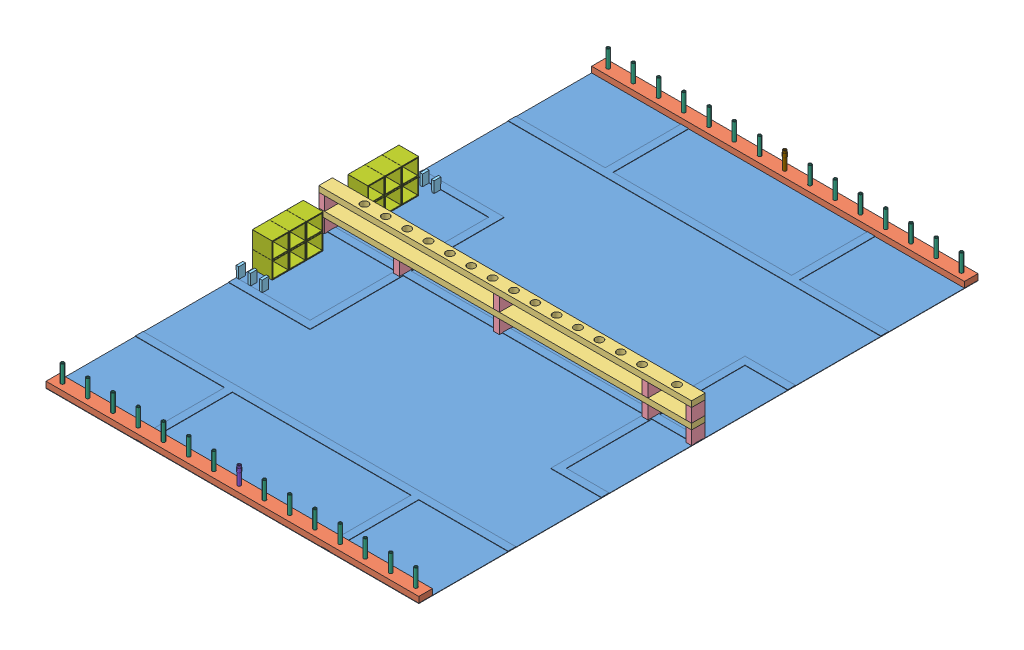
SolidWorks assembly 2020 Field Assembly.SLDASM, configuration Default (file format 12000). Lengths in mm.
Overall size (2438.4 256.54 3657.6).
64 component instances, 9 part files, 87 mates.
Components (placement in the parent):
- Floor-1: Floor.SLDPRT [Default] at (0 0 1828.8) size (2438.4 5.08 3657.6)
- Starting Piece-4: Starting Piece.SLDPRT [Default] at (0 2.54 1828.8) size (2438.4 38.1 88.9)
- Test Tube Rack-1: Test Tube Rack.SLDPRT [Bottom Shelf] at (0 91.44 44.45) size (2438.4 38.1 88.9)
- Spacer-1: Spacer.SLDPRT [Default] at (2438.4 2.54 44.45) x (0 1 0) z (0 0 1) size (88.9 38.1 88.9)
- Spacer-2: Spacer.SLDPRT [Default] at (38.1 2.54 44.45) x (0 1 0) z (0 0 1) size (88.9 38.1 88.9)
- Sample (tic tac box)-1: Sample (tic tac box).SLDPRT [Default] at (169.0687 2.54 541.3375) x (0 0 1) z (-1 0 0) size (44.45 73.03 16.67)
- Sample (tic tac box)-3: Sample (tic tac box).SLDPRT [Default] at (16.6687 2.54 541.3375) x (0 0 1) z (-1 0 0) size (44.45 73.03 16.67)
- Sample (tic tac box)-4: Sample (tic tac box).SLDPRT [Default] at (92.8688 2.54 541.3375) x (0 0 1) z (-1 0 0) size (44.45 73.03 16.67)
- Spacer-3: Spacer.SLDPRT [Default] at (527.05 2.54 44.45) x (0 1 0) z (0 0 1) size (88.9 38.1 88.9)
- Test Tube-1: Test Tube.SLDPRT [Default] at (2374.9 2.54 1784.35) x (0.214665 0 0.976688) z (-0.976688 0 0.214665) size (21.34 152.4 21.34)
- Test Tube-2: Test Tube.SLDPRT [Default] at (1714.5 2.54 1784.35) x (-0.112737 0 0.993625) z (-0.993625 0 -0.112737) size (21.34 152.4 21.34)
- Test Tube-3: Test Tube.SLDPRT [Default] at (889 2.54 1784.35) x (0.923132 0 0.384484) z (-0.384484 0 0.923132) size (21.34 152.4 21.34)
- Test Tube-4: Test Tube.SLDPRT [Default] at (1054.1 2.54 1784.35) x (0.923132 0 0.384484) z (-0.384484 0 0.923132) size (21.34 152.4 21.34)
- Test Tube-5: Test Tube.SLDPRT [Default] at (2044.7 2.54 1784.35) x (0.923132 0 0.384484) z (-0.384484 0 0.923132) size (21.34 152.4 21.34)
- Test Tube-6: Test Tube.SLDPRT [Default] at (1384.3 2.54 1784.35) x (0.923132 0 0.384484) z (-0.384484 0 0.923132) size (21.34 152.4 21.34)
- Test Tube-7: Test Tube.SLDPRT [Default] at (1879.6 2.54 1784.35) x (0.923132 0 0.384484) z (-0.384484 0 0.923132) size (21.34 152.4 21.34)
- Test Tube-9: Test Tube.SLDPRT [Default] at (1549.4 2.54 1784.35) x (0.923132 0 0.384484) z (-0.384484 0 0.923132) size (21.34 152.4 21.34)
- Test Tube-10: Test Tube.SLDPRT [Default] at (2209.8 2.54 1784.35) x (0.923132 0 0.384484) z (-0.384484 0 0.923132) size (21.34 152.4 21.34)
- Test Tube-11: Test Tube.SLDPRT [Default] at (63.5 2.54 1784.35) x (0.3427 0 -0.939445) z (0.939445 0 0.3427) size (21.34 152.4 21.34)
- Test Tube-12: Test Tube.SLDPRT [Default] at (228.6 2.54 1784.35) x (0.923132 0 0.384484) z (-0.384484 0 0.923132) size (21.34 152.4 21.34)
- Test Tube-13: Test Tube.SLDPRT [Default] at (393.7 2.54 1784.35) x (-0.643462 0 -0.765478) z (0.765478 0 -0.643462) size (21.34 152.4 21.34)
- Test Tube-14: Test Tube.SLDPRT [Default] at (558.8 2.54 1784.35) x (-0.689225 0 0.724547) z (-0.724547 0 -0.689225) size (21.34 152.4 21.34)
- Test Tube-15: Test Tube.SLDPRT [Default] at (723.9 2.54 1784.35) x (0.923132 0 0.384484) z (-0.384484 0 0.923132) size (21.34 152.4 21.34)
- Spacer-4: Spacer.SLDPRT [Default] at (2152.65 2.54 44.45) x (0 1 0) z (0 0 1) size (88.9 38.1 88.9)
- Sample (tic tac box)-5: Sample (tic tac box).SLDPRT [Default] at (152.4 2.54 -541.3375) x (0 0 -1) z (1 0 0) size (44.45 73.03 16.67)
- Sample (tic tac box)-6: Sample (tic tac box).SLDPRT [Default] at (76.2 2.54 -541.3375) x (0 0 -1) z (1 0 0) size (44.45 73.03 16.67)
- Sample (tic tac box)-7: Sample (tic tac box).SLDPRT [Default] at (0 2.54 -541.3375) x (0 0 -1) z (1 0 0) size (44.45 73.03 16.67)
- Starting Piece-8: Starting Piece.SLDPRT [Default] at (0 2.54 -1739.9) size (2438.4 38.1 88.9)
- Test Tube-16: Test Tube.SLDPRT [Default] at (723.9 2.54 -1784.35) x (0.923132 0 -0.384484) z (0.384484 0 0.923132) size (21.34 152.4 21.34)
- Test Tube-17: Test Tube.SLDPRT [Default] at (558.8 2.54 -1784.35) x (-0.689225 0 -0.724547) z (0.724547 0 -0.689225) size (21.34 152.4 21.34)
- Test Tube-18: Test Tube.SLDPRT [Default] at (393.7 2.54 -1784.35) x (-0.643462 0 0.765478) z (-0.765478 0 -0.643462) size (21.34 152.4 21.34)
- Test Tube-19: Test Tube.SLDPRT [Default] at (228.6 2.54 -1784.35) x (0.923132 0 -0.384484) z (0.384484 0 0.923132) size (21.34 152.4 21.34)
- Test Tube-20: Test Tube.SLDPRT [Default] at (63.5 2.54 -1784.35) x (0.3427 0 0.939445) z (-0.939445 0 0.3427) size (21.34 152.4 21.34)
- Test Tube-21: Test Tube.SLDPRT [Default] at (2209.8 2.54 -1784.35) x (0.923132 0 -0.384484) z (0.384484 0 0.923132) size (21.34 152.4 21.34)
- Test Tube-22: Test Tube.SLDPRT [Default] at (1549.4 2.54 -1784.35) x (0.923132 0 -0.384484) z (0.384484 0 0.923132) size (21.34 152.4 21.34)
- Test Tube-24: Test Tube.SLDPRT [Default] at (1879.6 2.54 -1784.35) x (0.923132 0 -0.384484) z (0.384484 0 0.923132) size (21.34 152.4 21.34)
- Test Tube-25: Test Tube.SLDPRT [Default] at (1384.3 2.54 -1784.35) x (0.923132 0 -0.384484) z (0.384484 0 0.923132) size (21.34 152.4 21.34)
- Test Tube-26: Test Tube.SLDPRT [Default] at (2044.7 2.54 -1784.35) x (0.923132 0 -0.384484) z (0.384484 0 0.923132) size (21.34 152.4 21.34)
- Test Tube-27: Test Tube.SLDPRT [Default] at (1054.1 2.54 -1784.35) x (0.923132 0 -0.384484) z (0.384484 0 0.923132) size (21.34 152.4 21.34)
- Test Tube-28: Test Tube.SLDPRT [Default] at (889 2.54 -1784.35) x (0.923132 0 -0.384484) z (0.384484 0 0.923132) size (21.34 152.4 21.34)
- Test Tube-29: Test Tube.SLDPRT [Default] at (1714.5 2.54 -1784.35) x (-0.112737 0 -0.993625) z (0.993625 0 -0.112737) size (21.34 152.4 21.34)
- Test Tube-30: Test Tube.SLDPRT [Default] at (2374.9 2.54 -1784.35) x (0.214665 0 -0.976688) z (0.976688 0 0.214665) size (21.34 152.4 21.34)
- Centrifuge-1: Centrifuge.SLDASM [Default] at (0 2.54 479.425) size (130.18 222.25 333.38)
  - Tissue Box-1: Tissue Box.SLDPRT [Default] at (0 111.125 0) x (0 -1 0) z (0 0 1) size (111.12 130.18 111.12)
  - Tissue Box-2: Tissue Box.SLDPRT [Default] at (0 222.25 0) x (0 -1 0) z (0 0 1) size (111.12 130.18 111.12)
  - Tissue Box-3: Tissue Box.SLDPRT [Default] at (0 111.125 -111.125) x (0 -1 0) z (0 0 1) size (111.12 130.18 111.12)
  - Tissue Box-4: Tissue Box.SLDPRT [Default] at (0 111.125 -222.25) x (0 -1 0) z (0 0 1) size (111.12 130.18 111.12)
  - Tissue Box-5: Tissue Box.SLDPRT [Default] at (0 222.25 -222.25) x (0 -1 0) z (0 0 1) size (111.12 130.18 111.12)
  - Tissue Box-6: Tissue Box.SLDPRT [Default] at (0 222.25 -111.125) x (0 -1 0) z (0 0 1) size (111.12 130.18 111.12)
- Centrifuge-2: Centrifuge.SLDASM [Default] at (0 224.79 -479.425) x (1 0 0) z (0 0 -1) size (130.18 222.25 333.38)
  - Tissue Box-1: Tissue Box.SLDPRT [Default] at (0 111.125 0) x (0 -1 0) z (0 0 1) size (111.12 130.18 111.12)
  - Tissue Box-2: Tissue Box.SLDPRT [Default] at (0 222.25 0) x (0 -1 0) z (0 0 1) size (111.12 130.18 111.12)
  - Tissue Box-3: Tissue Box.SLDPRT [Default] at (0 111.125 -111.125) x (0 -1 0) z (0 0 1) size (111.12 130.18 111.12)
  - Tissue Box-4: Tissue Box.SLDPRT [Default] at (0 111.125 -222.25) x (0 -1 0) z (0 0 1) size (111.12 130.18 111.12)
  - Tissue Box-5: Tissue Box.SLDPRT [Default] at (0 222.25 -222.25) x (0 -1 0) z (0 0 1) size (111.12 130.18 111.12)
  - Tissue Box-6: Tissue Box.SLDPRT [Default] at (0 222.25 -111.125) x (0 -1 0) z (0 0 1) size (111.12 130.18 111.12)
- Spacer-5: Spacer.SLDPRT [Default] at (2438.4 129.54 44.45) x (0 1 0) z (0 0 1) size (88.9 38.1 88.9)
- Spacer-6: Spacer.SLDPRT [Default] at (2152.65 129.54 44.45) x (0 1 0) z (0 0 1) size (88.9 38.1 88.9)
- Spacer-7: Spacer.SLDPRT [Default] at (38.1 129.54 44.45) x (0 1 0) z (0 0 1) size (88.9 38.1 88.9)
- Spacer-8: Spacer.SLDPRT [Default] at (1181.1 129.54 44.45) x (0 1 0) z (0 0 1) size (88.9 38.1 88.9)
- Test Tube Rack-2: Test Tube Rack.SLDPRT [Default] at (0 218.44 44.45) size (2438.4 38.1 88.9)
- Spacer-9: Spacer.SLDPRT [Default] at (1181.1 2.54 44.45) x (0 1 0) z (0 0 1) size (88.9 38.1 88.9)
- Collabortention Test Tube Red-1: Collabortention Test Tube Red.SLDPRT [Default] at (1219.2 2.54 1784.35) size (23.88 152.4 23.88)
- Collabortention Test Tube Blue-1: Collabortention Test Tube Blue.SLDPRT [Default] at (1219.2 2.54 -1784.35) size (23.88 152.4 23.88)
Mates (geometry in assembly coordinates):
- Coincident9: coincident anti-aligned: plane of Floor-1 through (0 2.54 1828.8) normal (0 1 0); plane of Spacer-2 through (0 2.54 44.45) normal (0 -1 0)
- Coincident10: coincident anti-aligned: plane of Floor-1 through (0 2.54 1828.8) normal (0 1 0); plane of Spacer-1 through (2400.3 2.54 44.45) normal (0 -1 0)
- Coincident11: coincident aligned: plane of Test Tube Rack-1 through (0 129.54 44.45) normal (0 0 1); plane of Spacer-2 through (0 2.54 44.45) normal (0 0 1)
- Coincident12: coincident anti-aligned: plane of Test Tube Rack-1 through (0 91.44 44.45) normal (0 -1 0); plane of Spacer-2 through (0 91.44 44.45) normal (0 1 0)
- Coincident13: coincident aligned: plane of Test Tube Rack-1 through (0 129.54 44.45) normal (-1 0 0); plane of Spacer-2 through (0 2.54 44.45) normal (-1 0 0)
- Coincident14: coincident aligned: plane of Floor-1 through (0 2.54 1828.8) normal (-1 0 0); plane of Spacer-2 through (0 2.54 44.45) normal (-1 0 0)
- Coincident15: coincident anti-aligned: plane of Test Tube Rack-1 through (0 91.44 44.45) normal (0 -1 0); plane of Spacer-1 through (2400.3 91.44 44.45) normal (0 1 0)
- Coincident16: coincident aligned: plane of Test Tube Rack-1 through (0 129.54 44.45) normal (0 0 1); plane of Spacer-1 through (2400.3 2.54 44.45) normal (0 0 1)
- Coincident17: coincident aligned: plane of Floor-1 through (2438.4 2.54 1828.8) normal (1 0 0); plane of Spacer-1 through (2438.4 2.54 44.45) normal (1 0 0)
- Width1: width aligned: plane of Spacer-1 through (2400.3 2.54 44.45) normal (0 0 1); plane of Spacer-1 through (2400.3 2.54 -44.45) normal (0 0 -1); plane of Floor-1 through (0 2.54 1828.8) normal (0 0 1); plane of Floor-1 through (0 2.54 -1828.8) normal (0 0 -1)
- Coincident50: coincident anti-aligned: plane of Floor-1 through (0 2.54 1828.8) normal (0 1 0); plane of Starting Piece-4 through (0 2.54 1828.8) normal (0 -1 0)
- Coincident51: coincident aligned: plane of Floor-1 through (0 2.54 1828.8) normal (0 0 1); plane of Starting Piece-4 through (0 40.64 1828.8) normal (0 0 1)
- Coincident58: coincident anti-aligned: plane of Floor-1 through (0 2.54 1828.8) normal (0 1 0); plane of Sample (tic tac box)-1 through (152.4 2.54 541.3375) normal (0 -1 0)
- Coincident59: coincident anti-aligned: plane of Floor-1 through (0 2.54 1828.8) normal (0 1 0); plane of Sample (tic tac box)-4 through (76.2 2.54 541.3375) normal (0 -1 0)
- Coincident60: coincident anti-aligned: plane of Floor-1 through (0 2.54 1828.8) normal (0 1 0); plane of Sample (tic tac box)-3 through (0 2.54 541.3375) normal (0 -1 0)
- Coincident61: coincident: plane of Floor-1 through (0 2.54 1828.8) normal (-1 0 0); line of Sample (tic tac box)-3 through (0 75.565 584.9937) axis (0 0 -1)
- Coincident63: coincident aligned: plane of Sample (tic tac box)-1 through (152.4 2.54 584.2) normal (0 -0.010869 0.999941); plane of Sample (tic tac box)-4 through (76.2 2.54 584.2) normal (0 -0.010869 0.999941)
- Coincident64: coincident aligned: plane of Sample (tic tac box)-3 through (0 2.54 584.2) normal (0 -0.010869 0.999941); plane of Sample (tic tac box)-4 through (76.2 2.54 584.2) normal (0 -0.010869 0.999941)
- Width3: width anti-aligned: plane of Sample (tic tac box)-3 through (15.8751 2.5486 540.5438) normal (0.999941 -0.010869 0); plane of Sample (tic tac box)-4 through (153.1956 2.3675 540.5438) normal (-0.999941 -0.010869 0); plane of Sample (tic tac box)-1 through (76.9956 2.3675 540.5438) normal (-0.999941 -0.010869 0); plane of Sample (tic tac box)-4 through (92.0751 2.5486 540.5438) normal (0.999941 -0.010869 0)
- Coincident65: coincident aligned: line of Floor-1 through (15.875 2.54 584.2) axis (1 0 0); line of Sample (tic tac box)-4 through (76.9938 2.54 584.2) axis (1 0 0)
- Coincident66: coincident aligned: plane of Test Tube Rack-1 through (0 129.54 44.45) normal (0 0 1); plane of Spacer-3 through (488.95 2.54 44.45) normal (0 0 1)
- Coincident67: coincident anti-aligned: plane of Floor-1 through (0 2.54 1828.8) normal (0 1 0); plane of Spacer-3 through (488.95 2.54 44.45) normal (0 -1 0)
- Distance2: distance = 450.85 mm anti-aligned: plane of Spacer-3 through (488.95 2.54 44.45) normal (-1 0 0); plane of Spacer-2 through (38.1 2.54 44.45) normal (1 0 0)
- Coincident85: coincident anti-aligned: plane of Test Tube Rack-1 through (0 91.44 44.45) normal (0 -1 0); plane of Spacer-4 through (2114.55 91.44 44.45) normal (0 1 0)
- Coincident86: coincident aligned: plane of Test Tube Rack-1 through (0 129.54 44.45) normal (0 0 1); plane of Spacer-4 through (2114.55 2.54 44.45) normal (0 0 1)
- Distance3: distance = 247.65 mm anti-aligned: plane of Spacer-4 through (2152.65 2.54 44.45) normal (1 0 0); plane of Spacer-1 through (2400.3 2.54 44.45) normal (-1 0 0)
- Symmetric2: symmetric aligned: plane of Floor-1 through (0 2.54 1828.8) normal (0 0 1); plane of Floor-1 through (0 2.54 -1828.8) normal (0 0 -1)
- Coincident88: coincident anti-aligned: plane of Floor-1 through (0 0 1828.8) normal (0 -1 0)
- Coincident89: coincident anti-aligned: plane of Floor-1 through (0 2.54 1828.8) normal (-1 0 0)
- Coincident91: coincident anti-aligned: plane of Floor-1 through (0 2.54 1828.8) normal (0 1 0); plane of Centrifuge-1/Tissue Box-1 through (130.175 2.54 479.425) normal (0 -1 0)
- Distance4: distance = 101.6 mm anti-aligned: plane of Centrifuge-1/Tissue Box-5 through (130.175 224.79 146.05) normal (0 0 -1); plane of Test Tube Rack-1 through (0 129.54 44.45) normal (0 0 1)
- Coincident93: coincident aligned: plane of Floor-1 through (0 2.54 1828.8) normal (-1 0 0); plane of Centrifuge-1/Tissue Box-5 through (0 224.79 257.175) normal (-1 0 0)
- Coincident94: coincident anti-aligned: plane of Floor-1 through (0 2.54 1828.8) normal (0 1 0); plane of Centrifuge-2/Tissue Box-5 through (130.175 2.54 -257.175) normal (0 -1 0)
- Coincident95: coincident aligned: plane of Floor-1 through (0 2.54 1828.8) normal (-1 0 0); plane of Centrifuge-2/Tissue Box-6 through (0 2.54 -368.3) normal (-1 0 0)
- Distance5: distance = 101.6 mm anti-aligned: plane of Centrifuge-2/Tissue Box-5 through (130.175 2.54 -146.05) normal (0 0 1); plane of Spacer-2 through (0 2.54 -44.45) normal (0 0 -1)
- Coincident97: coincident aligned: plane of Floor-1 through (2438.4 2.54 1828.8) normal (1 0 0); plane of Starting Piece-4 through (2438.4 40.64 1828.8) normal (1 0 0)
- Coincident98: coincident aligned: plane of Test Tube Rack-1 through (0 129.54 44.45) normal (0 0 1); plane of Spacer-8 through (1143 129.54 44.45) normal (0 0 1)
- Coincident99: coincident aligned: plane of Test Tube Rack-1 through (0 129.54 44.45) normal (0 0 1); plane of Spacer-6 through (2114.55 129.54 44.45) normal (0 0 1)
- Coincident100: coincident aligned: plane of Test Tube Rack-1 through (0 129.54 44.45) normal (0 0 1); plane of Spacer-5 through (2400.3 129.54 44.45) normal (0 0 1)
- Coincident101: coincident aligned: plane of Test Tube Rack-1 through (0 129.54 44.45) normal (0 0 1); plane of Spacer-7 through (0 129.54 44.45) normal (0 0 1)
- Coincident102: coincident aligned: plane of Test Tube Rack-1 through (0 129.54 44.45) normal (0 0 1); plane of Test Tube Rack-2 through (0 256.54 44.45) normal (0 0 1)
- Coincident103: coincident anti-aligned: plane of Test Tube Rack-1 through (0 129.54 44.45) normal (0 1 0); plane of Spacer-7 through (0 129.54 44.45) normal (0 -1 0)
- Coincident104: coincident anti-aligned: plane of Test Tube Rack-1 through (0 129.54 44.45) normal (0 1 0); plane of Spacer-8 through (1143 129.54 44.45) normal (0 -1 0)
- Coincident105: coincident anti-aligned: plane of Test Tube Rack-1 through (0 129.54 44.45) normal (0 1 0); plane of Spacer-6 through (2114.55 129.54 44.45) normal (0 -1 0)
- Coincident106: coincident anti-aligned: plane of Test Tube Rack-1 through (0 129.54 44.45) normal (0 1 0); plane of Spacer-5 through (2400.3 129.54 44.45) normal (0 -1 0)
- Coincident107: coincident aligned: plane of Spacer-1 through (2438.4 2.54 44.45) normal (1 0 0); plane of Spacer-5 through (2438.4 129.54 44.45) normal (1 0 0)
- Coincident108: coincident aligned: plane of Spacer-4 through (2152.65 2.54 44.45) normal (1 0 0); plane of Spacer-6 through (2152.65 129.54 44.45) normal (1 0 0)
- Coincident109: coincident aligned: plane of Spacer-5 through (2438.4 129.54 44.45) normal (1 0 0); plane of Test Tube Rack-2 through (2438.4 256.54 44.45) normal (1 0 0)
- Coincident110: coincident anti-aligned: plane of Spacer-6 through (2114.55 218.44 44.45) normal (0 1 0); plane of Test Tube Rack-2 through (0 218.44 44.45) normal (0 -1 0)
- Coincident111: coincident aligned: plane of Spacer-7 through (0 129.54 44.45) normal (-1 0 0); plane of Test Tube Rack-2 through (0 256.54 44.45) normal (-1 0 0)
- Distance6: distance = 933.45 mm anti-aligned: plane of Spacer-8 through (1181.1 129.54 44.45) normal (1 0 0); plane of Spacer-6 through (2114.55 129.54 44.45) normal (-1 0 0)
- Coincident113: coincident anti-aligned: plane of Floor-1 through (0 2.54 1828.8) normal (0 1 0); plane of Spacer-9 through (1143 2.54 44.45) normal (0 -1 0)
- Coincident114: coincident aligned: plane of Spacer-8 through (1143 129.54 44.45) normal (0 0 1); plane of Spacer-9 through (1143 2.54 44.45) normal (0 0 1)
- Coincident115: coincident aligned: plane of Spacer-8 through (1181.1 129.54 44.45) normal (1 0 0); plane of Spacer-9 through (1181.1 2.54 44.45) normal (1 0 0)
- Coincident116: coincident anti-aligned: plane of Floor-1 through (0 2.54 1828.8) normal (0 1 0); plane of Test Tube-7 through (1879.6 2.54 1784.35) normal (0 -1 0)
- Coincident117: coincident anti-aligned: plane of Floor-1 through (0 2.54 1828.8) normal (0 1 0); plane of Test Tube-9 through (1549.4 2.54 1784.35) normal (0 -1 0)
- Coincident118: coincident anti-aligned: plane of Floor-1 through (0 2.54 1828.8) normal (0 1 0); plane of Test Tube-1 through (2374.9 2.54 1784.35) normal (0 -1 0)
- Coincident119: coincident anti-aligned: plane of Floor-1 through (0 2.54 1828.8) normal (0 1 0); plane of Test Tube-10 through (2209.8 2.54 1784.35) normal (0 -1 0)
- Coincident120: coincident aligned: plane of Floor-1 through (0 2.54 1828.8) normal (0 1 0); circle of Test Tube-4
- Coincident121: coincident aligned: plane of Floor-1 through (0 2.54 1828.8) normal (0 1 0); circle of Test Tube-5
- Coincident122: coincident anti-aligned: plane of Floor-1 through (0 2.54 1828.8) normal (0 1 0); plane of Test Tube-3 through (889 2.54 1784.35) normal (0 -1 0)
- Coincident123: coincident anti-aligned: plane of Floor-1 through (0 2.54 1828.8) normal (0 1 0); plane of Test Tube-2 through (1714.5 2.54 1784.35) normal (0 -1 0)
- Coincident125: coincident anti-aligned: plane of Floor-1 through (0 2.54 1828.8) normal (0 1 0); plane of Test Tube-15 through (723.9 2.54 1784.35) normal (0 -1 0)
- Coincident126: coincident anti-aligned: plane of Floor-1 through (0 2.54 1828.8) normal (0 1 0); plane of Test Tube-14 through (558.8 2.54 1784.35) normal (0 -1 0)
- Coincident127: coincident anti-aligned: plane of Floor-1 through (0 2.54 1828.8) normal (0 1 0); plane of Test Tube-13 through (393.7 2.54 1784.35) normal (0 -1 0)
- Coincident128: coincident anti-aligned: plane of Floor-1 through (0 2.54 1828.8) normal (0 1 0); plane of Test Tube-12 through (228.6 2.54 1784.35) normal (0 -1 0)
- Coincident129: coincident anti-aligned: plane of Floor-1 through (0 2.54 1828.8) normal (0 1 0); plane of Test Tube-11 through (63.5 2.54 1784.35) normal (0 -1 0)
- Concentric3: concentric anti-aligned: cylinder of Starting Piece-4 through (1054.1 2.54 1784.35) axis (0 1 0) radius 11.1125; cylinder of Test Tube-4 through (1054.1 154.94 1784.35) axis (0 -1 0) radius 10.668
- Concentric4: concentric anti-aligned: cylinder of Starting Piece-4 through (889 2.54 1784.35) axis (0 1 0) radius 11.1125; cylinder of Test Tube-3 through (889 154.94 1784.35) axis (0 -1 0) radius 10.668
- Concentric5: concentric anti-aligned: circle of Starting Piece-4; cylinder of Test Tube-15 through (723.9 154.94 1784.35) axis (0 -1 0) radius 10.668
- Concentric6: concentric anti-aligned: circle of Starting Piece-4; cylinder of Test Tube-14 through (558.8 154.94 1784.35) axis (0 -1 0) radius 10.668
- Concentric7: concentric anti-aligned: circle of Starting Piece-4; cylinder of Test Tube-13 through (393.7 154.94 1784.35) axis (0 -1 0) radius 10.668
- Concentric8: concentric anti-aligned: circle of Starting Piece-4; cylinder of Test Tube-12 through (228.6 154.94 1784.35) axis (0 -1 0) radius 10.668
- Concentric9: concentric anti-aligned: cylinder of Starting Piece-4 through (63.5 2.54 1784.35) axis (0 1 0) radius 11.1125; cylinder of Test Tube-11 through (63.5 154.94 1784.35) axis (0 -1 0) radius 10.668
- Concentric10: concentric anti-aligned: circle of Starting Piece-4; cylinder of Test Tube-6 through (1384.3 154.94 1784.35) axis (0 -1 0) radius 10.668
- Concentric11: concentric anti-aligned: cylinder of Starting Piece-4 through (1549.4 2.54 1784.35) axis (0 1 0) radius 11.1125; cylinder of Test Tube-9 through (1549.4 154.94 1784.35) axis (0 -1 0) radius 10.668
- Concentric12: concentric anti-aligned: circle of Starting Piece-4; cylinder of Test Tube-2 through (1714.5 154.94 1784.35) axis (0 -1 0) radius 10.668
- Concentric13: concentric anti-aligned: circle of Starting Piece-4; cylinder of Test Tube-7 through (1879.6 154.94 1784.35) axis (0 -1 0) radius 10.668
- Concentric14: concentric anti-aligned: circle of Starting Piece-4; cylinder of Test Tube-5 through (2044.7 154.94 1784.35) axis (0 -1 0) radius 10.668
- Concentric15: concentric anti-aligned: circle of Starting Piece-4; cylinder of Test Tube-10 through (2209.8 154.94 1784.35) axis (0 -1 0) radius 10.668
- Concentric16: concentric anti-aligned: circle of Starting Piece-4; cylinder of Test Tube-1 through (2374.9 154.94 1784.35) axis (0 -1 0) radius 10.668
- Coincident130: coincident anti-aligned: plane of Floor-1 through (0 2.54 1828.8) normal (0 1 0); plane of Test Tube-6 through (1384.3 2.54 1784.35) normal (0 -1 0)
- Coincident131: coincident: plane of Floor-1 through (168.275 5.08 1828.8) normal (1 0 0); line of Sample (tic tac box)-1 through (168.275 2.54 541.3375) axis (0 0 1)
- Concentric17: concentric anti-aligned: cylinder of Starting Piece-4 through (1219.2 2.54 1784.35) axis (0 1 0) radius 11.1125; cylinder of Collabortention Test Tube Red-1 through (1219.2 154.94 1784.35) axis (0 -1 0) radius 10.668
- Coincident132: coincident anti-aligned: plane of Floor-1 through (0 2.54 1828.8) normal (0 1 0); plane of Collabortention Test Tube Red-1 through (1219.2 2.54 1784.35) normal (0 -1 0)
- Concentric18: concentric anti-aligned: cylinder of Starting Piece-8 through (1219.2 2.54 -1784.35) axis (0 1 0) radius 11.1125; cylinder of Collabortention Test Tube Blue-1 through (1219.2 154.94 -1784.35) axis (0 -1 0) radius 10.668
- Coincident133: coincident anti-aligned: plane of Floor-1 through (0 2.54 1828.8) normal (0 1 0); plane of Collabortention Test Tube Blue-1 through (1219.2 2.54 -1784.35) normal (0 -1 0)
